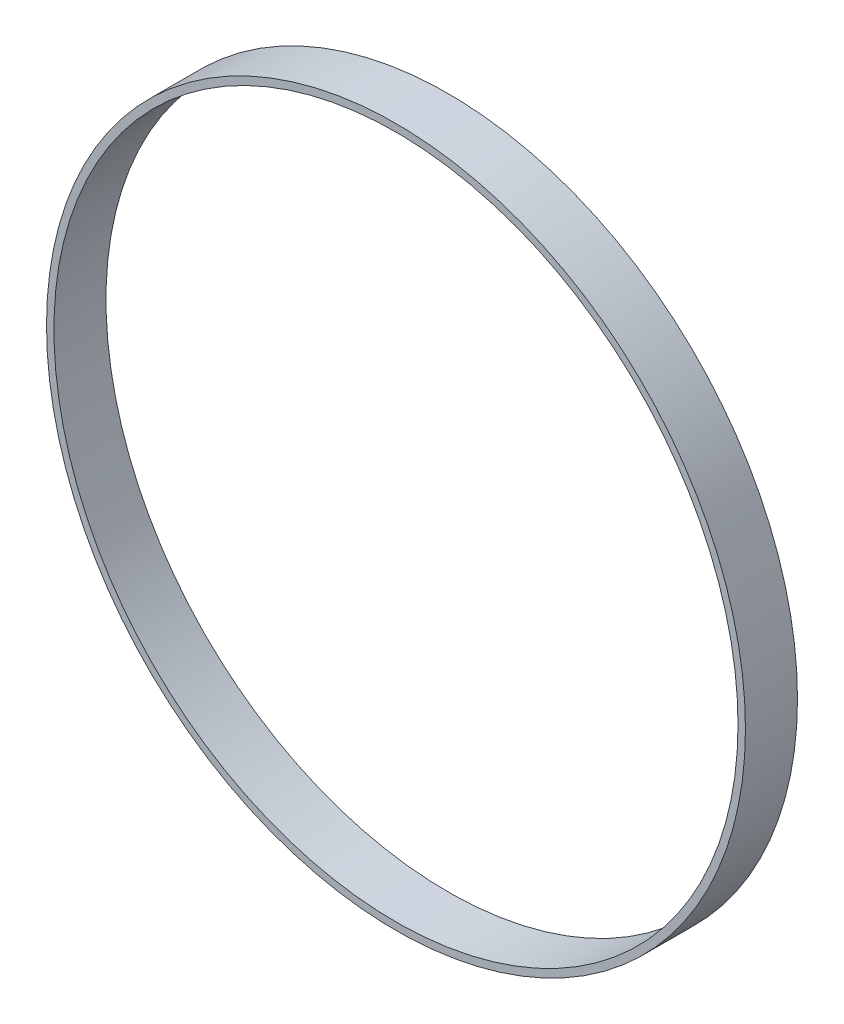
from build123d import *

# Parameters (mm, degrees)
ESQUISSE1_R      = 47
ESQUISSE1_R_2    = 46
EXTRUSION1_DEPTH = 7


with BuildPart() as part:
    # Esquisse1 → Extrusion1 (new body)
    with BuildSketch(Plane.XY):
        Circle(ESQUISSE1_R)
        Circle(ESQUISSE1_R_2, mode=Mode.SUBTRACT)
    extrude(amount=EXTRUSION1_DEPTH)


solid = part.part
